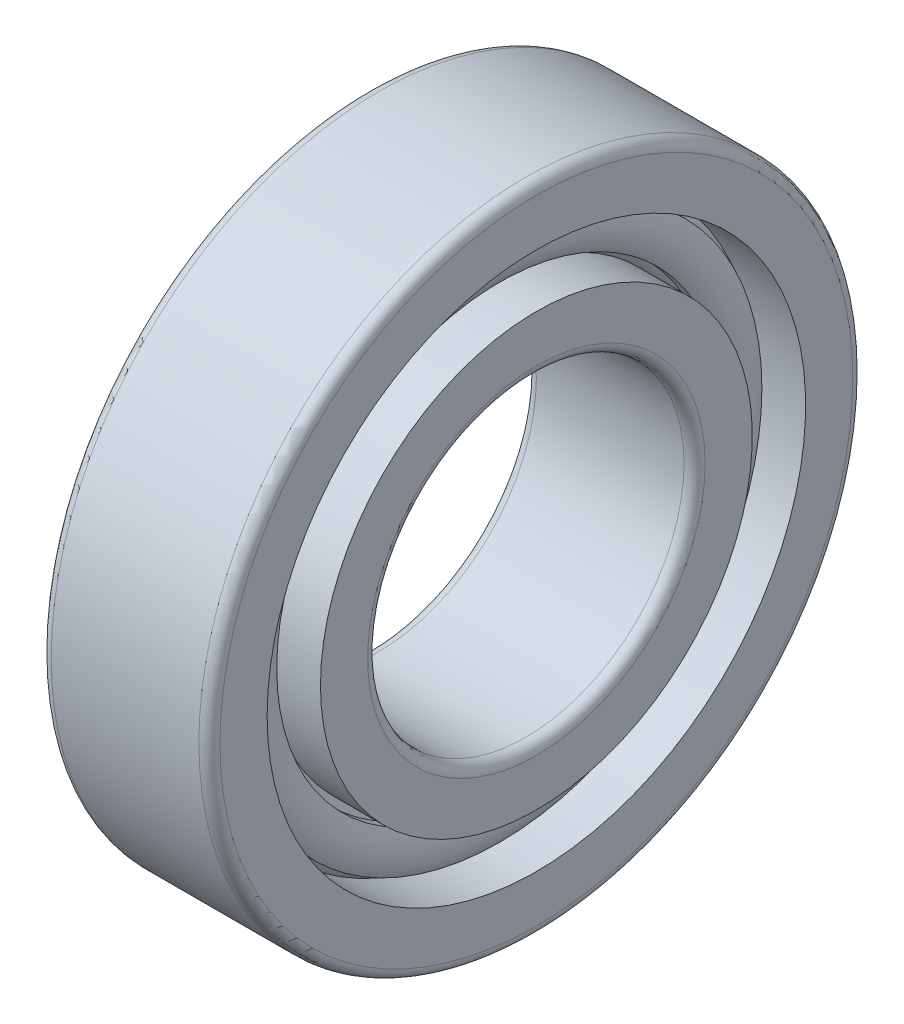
ISO-10303-21;
HEADER;
FILE_DESCRIPTION(('STEP AP214'),'2;1');
FILE_NAME('part.step','',(''),(''),'','','');
FILE_SCHEMA(('AUTOMOTIVE_DESIGN { 1 0 10303 214 1 1 1 1 }'));
ENDSEC;
DATA;
#1=APPLICATION_CONTEXT('core data for automotive mechanical design processes');
#2=APPLICATION_PROTOCOL_DEFINITION('international standard','automotive_design',2000,#1);
#3=PRODUCT_CONTEXT('',#1,'mechanical');
#4=PRODUCT('Part','Part','',(#3));
#5=PRODUCT_RELATED_PRODUCT_CATEGORY('part','',(#4));
#6=PRODUCT_DEFINITION_FORMATION('','',#4);
#7=PRODUCT_DEFINITION_CONTEXT('part definition',#1,'design');
#8=PRODUCT_DEFINITION('design','',#6,#7);
#9=PRODUCT_DEFINITION_SHAPE('','',#8);
#10=(LENGTH_UNIT() NAMED_UNIT(*) SI_UNIT(.MILLI.,.METRE.));
#11=(NAMED_UNIT(*) PLANE_ANGLE_UNIT() SI_UNIT($,.RADIAN.));
#12=(NAMED_UNIT(*) SI_UNIT($,.STERADIAN.) SOLID_ANGLE_UNIT());
#13=UNCERTAINTY_MEASURE_WITH_UNIT(LENGTH_MEASURE(1.E-05),#10,'distance_accuracy_value','');
#14=(GEOMETRIC_REPRESENTATION_CONTEXT(3) GLOBAL_UNCERTAINTY_ASSIGNED_CONTEXT((#13)) GLOBAL_UNIT_ASSIGNED_CONTEXT((#10,
#11,#12)) REPRESENTATION_CONTEXT('',''));
#15=CARTESIAN_POINT('',(0.,0.,0.));
#16=DIRECTION('',(0.,0.,1.));
#17=DIRECTION('',(1.,0.,0.));
#18=AXIS2_PLACEMENT_3D('',#15,#16,#17);
#19=CARTESIAN_POINT('',(15.,0.,0.));
#20=DIRECTION('',(-1.,0.,0.));
#21=DIRECTION('',(0.,0.,1.));
#22=AXIS2_PLACEMENT_3D('',#19,#20,#21);
#23=CYLINDRICAL_SURFACE('',#22,15.);
#24=CARTESIAN_POINT('',(1.,0.,0.));
#25=DIRECTION('',(1.,0.,0.));
#26=DIRECTION('',(0.,0.,-1.));
#27=AXIS2_PLACEMENT_3D('',#24,#25,#26);
#28=CIRCLE('',#27,15.);
#29=CARTESIAN_POINT('',(1.,0.,-15.));
#30=VERTEX_POINT('',#29);
#31=EDGE_CURVE('E228',#30,#30,#28,.T.);
#32=ORIENTED_EDGE('',*,*,#31,.F.);
#33=EDGE_LOOP('',(#32));
#34=FACE_BOUND('',#33,.T.);
#35=CARTESIAN_POINT('',(15.,0.,0.));
#36=DIRECTION('',(1.,0.,0.));
#37=DIRECTION('',(0.,0.,-1.));
#38=AXIS2_PLACEMENT_3D('',#35,#36,#37);
#39=CIRCLE('',#38,15.);
#40=CARTESIAN_POINT('',(15.,0.,-15.));
#41=VERTEX_POINT('',#40);
#42=EDGE_CURVE('E224',#41,#41,#39,.F.);
#43=ORIENTED_EDGE('',*,*,#42,.F.);
#44=EDGE_LOOP('',(#43));
#45=FACE_BOUND('',#44,.T.);
#46=ADVANCED_FACE('F14',(#34,#45),#23,.F.);
#47=CARTESIAN_POINT('',(1.,0.,0.));
#48=DIRECTION('',(1.,0.,0.));
#49=DIRECTION('',(0.,0.,-1.));
#50=AXIS2_PLACEMENT_3D('',#47,#48,#49);
#51=TOROIDAL_SURFACE('',#50,16.,1.);
#52=CARTESIAN_POINT('',(0.,0.,0.));
#53=DIRECTION('',(-1.,0.,0.));
#54=DIRECTION('',(0.,0.,-1.));
#55=AXIS2_PLACEMENT_3D('',#52,#53,#54);
#56=CIRCLE('',#55,16.);
#57=CARTESIAN_POINT('',(0.,0.,-16.));
#58=VERTEX_POINT('',#57);
#59=EDGE_CURVE('E227',#58,#58,#56,.F.);
#60=ORIENTED_EDGE('',*,*,#59,.F.);
#61=EDGE_LOOP('',(#60));
#62=FACE_BOUND('',#61,.T.);
#63=ORIENTED_EDGE('',*,*,#31,.T.);
#64=EDGE_LOOP('',(#63));
#65=FACE_BOUND('',#64,.T.);
#66=ADVANCED_FACE('F244',(#62,#65),#51,.T.);
#67=CARTESIAN_POINT('',(15.,0.,0.));
#68=DIRECTION('',(1.,0.,0.));
#69=DIRECTION('',(0.,0.,-1.));
#70=AXIS2_PLACEMENT_3D('',#67,#68,#69);
#71=TOROIDAL_SURFACE('',#70,16.,1.);
#72=ORIENTED_EDGE('',*,*,#42,.T.);
#73=EDGE_LOOP('',(#72));
#74=FACE_BOUND('',#73,.T.);
#75=CARTESIAN_POINT('',(16.,0.,0.));
#76=DIRECTION('',(1.,0.,0.));
#77=DIRECTION('',(0.,0.,-1.));
#78=AXIS2_PLACEMENT_3D('',#75,#76,#77);
#79=CIRCLE('',#78,16.);
#80=CARTESIAN_POINT('',(16.,0.,-16.));
#81=VERTEX_POINT('',#80);
#82=EDGE_CURVE('E190',#81,#81,#79,.F.);
#83=ORIENTED_EDGE('',*,*,#82,.F.);
#84=EDGE_LOOP('',(#83));
#85=FACE_BOUND('',#84,.T.);
#86=ADVANCED_FACE('F211',(#74,#85),#71,.T.);
#87=CARTESIAN_POINT('',(0.,20.472,0.));
#88=DIRECTION('',(-1.,0.,0.));
#89=DIRECTION('',(0.,0.,1.));
#90=AXIS2_PLACEMENT_3D('',#87,#88,#89);
#91=PLANE('',#90);
#92=CARTESIAN_POINT('',(0.,0.,0.));
#93=DIRECTION('',(-1.,0.,0.));
#94=DIRECTION('',(0.,0.,1.));
#95=AXIS2_PLACEMENT_3D('',#92,#93,#94);
#96=CIRCLE('',#95,20.472);
#97=CARTESIAN_POINT('',(0.,0.,20.472));
#98=VERTEX_POINT('',#97);
#99=EDGE_CURVE('E17',#98,#98,#96,.F.);
#100=ORIENTED_EDGE('',*,*,#99,.F.);
#101=EDGE_LOOP('',(#100));
#102=FACE_BOUND('',#101,.T.);
#103=ORIENTED_EDGE('',*,*,#59,.T.);
#104=EDGE_LOOP('',(#103));
#105=FACE_BOUND('',#104,.T.);
#106=ADVANCED_FACE('F207',(#102,#105),#91,.T.);
#107=CARTESIAN_POINT('',(16.,16.,0.));
#108=DIRECTION('',(1.,0.,0.));
#109=DIRECTION('',(0.,0.,-1.));
#110=AXIS2_PLACEMENT_3D('',#107,#108,#109);
#111=PLANE('',#110);
#112=ORIENTED_EDGE('',*,*,#82,.T.);
#113=EDGE_LOOP('',(#112));
#114=FACE_BOUND('',#113,.T.);
#115=CARTESIAN_POINT('',(16.,0.,0.));
#116=DIRECTION('',(-1.,0.,0.));
#117=DIRECTION('',(0.,0.,1.));
#118=AXIS2_PLACEMENT_3D('',#115,#116,#117);
#119=CIRCLE('',#118,20.472);
#120=CARTESIAN_POINT('',(16.,0.,20.472));
#121=VERTEX_POINT('',#120);
#122=EDGE_CURVE('E183',#121,#121,#119,.T.);
#123=ORIENTED_EDGE('',*,*,#122,.F.);
#124=EDGE_LOOP('',(#123));
#125=FACE_BOUND('',#124,.T.);
#126=ADVANCED_FACE('F197',(#114,#125),#111,.T.);
#127=CARTESIAN_POINT('',(15.,0.,0.));
#128=DIRECTION('',(-1.,0.,0.));
#129=DIRECTION('',(0.,0.,1.));
#130=AXIS2_PLACEMENT_3D('',#127,#128,#129);
#131=CYLINDRICAL_SURFACE('',#130,20.472);
#132=CARTESIAN_POINT('',(4.882,0.,0.));
#133=DIRECTION('',(1.,0.,0.));
#134=DIRECTION('',(0.,0.,-1.));
#135=AXIS2_PLACEMENT_3D('',#132,#133,#134);
#136=CIRCLE('',#135,20.472);
#137=CARTESIAN_POINT('',(4.882,0.,-20.472));
#138=VERTEX_POINT('',#137);
#139=EDGE_CURVE('E180',#138,#138,#136,.T.);
#140=ORIENTED_EDGE('',*,*,#139,.F.);
#141=EDGE_LOOP('',(#140));
#142=FACE_BOUND('',#141,.T.);
#143=ORIENTED_EDGE('',*,*,#99,.T.);
#144=EDGE_LOOP('',(#143));
#145=FACE_BOUND('',#144,.T.);
#146=ADVANCED_FACE('F206',(#142,#145),#131,.T.);
#147=CARTESIAN_POINT('',(15.,0.,0.));
#148=DIRECTION('',(-1.,0.,0.));
#149=DIRECTION('',(0.,0.,1.));
#150=AXIS2_PLACEMENT_3D('',#147,#148,#149);
#151=CYLINDRICAL_SURFACE('',#150,20.472);
#152=ORIENTED_EDGE('',*,*,#122,.T.);
#153=EDGE_LOOP('',(#152));
#154=FACE_BOUND('',#153,.T.);
#155=CARTESIAN_POINT('',(11.117,0.,0.));
#156=DIRECTION('',(1.,0.,0.));
#157=DIRECTION('',(0.,0.,-1.));
#158=AXIS2_PLACEMENT_3D('',#155,#156,#157);
#159=CIRCLE('',#158,20.472);
#160=CARTESIAN_POINT('',(11.117,0.,-20.472));
#161=VERTEX_POINT('',#160);
#162=EDGE_CURVE('E158',#161,#161,#159,.F.);
#163=ORIENTED_EDGE('',*,*,#162,.F.);
#164=EDGE_LOOP('',(#163));
#165=FACE_BOUND('',#164,.T.);
#166=ADVANCED_FACE('F174',(#154,#165),#151,.T.);
#167=CARTESIAN_POINT('',(7.99919277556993,0.,0.));
#168=DIRECTION('',(1.,0.,0.));
#169=DIRECTION('',(0.,0.,-1.));
#170=AXIS2_PLACEMENT_3D('',#167,#168,#169);
#171=TOROIDAL_SURFACE('',#170,23.0008940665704,4.014);
#172=CARTESIAN_POINT('',(4.44,0.,0.));
#173=DIRECTION('',(-1.,0.,0.));
#174=DIRECTION('',(0.,0.,1.));
#175=AXIS2_PLACEMENT_3D('',#172,#173,#174);
#176=CIRCLE('',#175,21.145);
#177=CARTESIAN_POINT('',(4.44,0.,21.145));
#178=VERTEX_POINT('',#177);
#179=EDGE_CURVE('E153',#178,#178,#176,.T.);
#180=ORIENTED_EDGE('',*,*,#179,.T.);
#181=EDGE_LOOP('',(#180));
#182=FACE_BOUND('',#181,.T.);
#183=ORIENTED_EDGE('',*,*,#139,.T.);
#184=EDGE_LOOP('',(#183));
#185=FACE_BOUND('',#184,.T.);
#186=ADVANCED_FACE('F169',(#182,#185),#171,.T.);
#187=CARTESIAN_POINT('',(7.99980722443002,0.,0.));
#188=DIRECTION('',(1.,0.,0.));
#189=DIRECTION('',(0.,0.,-1.));
#190=AXIS2_PLACEMENT_3D('',#187,#188,#189);
#191=TOROIDAL_SURFACE('',#190,23.0008940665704,4.01400000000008);
#192=ORIENTED_EDGE('',*,*,#162,.T.);
#193=EDGE_LOOP('',(#192));
#194=FACE_BOUND('',#193,.T.);
#195=CARTESIAN_POINT('',(11.559,0.,0.));
#196=DIRECTION('',(-1.,0.,0.));
#197=DIRECTION('',(0.,0.,1.));
#198=AXIS2_PLACEMENT_3D('',#195,#196,#197);
#199=CIRCLE('',#198,21.145);
#200=CARTESIAN_POINT('',(11.559,0.,21.145));
#201=VERTEX_POINT('',#200);
#202=EDGE_CURVE('E148',#201,#201,#199,.F.);
#203=ORIENTED_EDGE('',*,*,#202,.T.);
#204=EDGE_LOOP('',(#203));
#205=FACE_BOUND('',#204,.T.);
#206=ADVANCED_FACE('F165',(#194,#205),#191,.T.);
#207=CARTESIAN_POINT('',(15.,0.,0.));
#208=DIRECTION('',(-1.,0.,0.));
#209=DIRECTION('',(0.,0.,1.));
#210=AXIS2_PLACEMENT_3D('',#207,#208,#209);
#211=CYLINDRICAL_SURFACE('',#210,21.145);
#212=CARTESIAN_POINT('',(3.472,0.,0.));
#213=DIRECTION('',(1.,0.,0.));
#214=DIRECTION('',(0.,0.,-1.));
#215=AXIS2_PLACEMENT_3D('',#212,#213,#214);
#216=CIRCLE('',#215,21.145);
#217=CARTESIAN_POINT('',(3.472,0.,-21.145));
#218=VERTEX_POINT('',#217);
#219=EDGE_CURVE('E145',#218,#218,#216,.T.);
#220=ORIENTED_EDGE('',*,*,#219,.F.);
#221=EDGE_LOOP('',(#220));
#222=FACE_BOUND('',#221,.T.);
#223=ORIENTED_EDGE('',*,*,#179,.F.);
#224=EDGE_LOOP('',(#223));
#225=FACE_BOUND('',#224,.T.);
#226=ADVANCED_FACE('F168',(#222,#225),#211,.F.);
#227=CARTESIAN_POINT('',(15.,0.,0.));
#228=DIRECTION('',(-1.,0.,0.));
#229=DIRECTION('',(0.,0.,1.));
#230=AXIS2_PLACEMENT_3D('',#227,#228,#229);
#231=CYLINDRICAL_SURFACE('',#230,21.145);
#232=ORIENTED_EDGE('',*,*,#202,.F.);
#233=EDGE_LOOP('',(#232));
#234=FACE_BOUND('',#233,.T.);
#235=CARTESIAN_POINT('',(12.528,0.,0.));
#236=DIRECTION('',(1.,0.,0.));
#237=DIRECTION('',(0.,0.,-1.));
#238=AXIS2_PLACEMENT_3D('',#235,#236,#237);
#239=CIRCLE('',#238,21.145);
#240=CARTESIAN_POINT('',(12.528,0.,-21.145));
#241=VERTEX_POINT('',#240);
#242=EDGE_CURVE('E122',#241,#241,#239,.F.);
#243=ORIENTED_EDGE('',*,*,#242,.F.);
#244=EDGE_LOOP('',(#243));
#245=FACE_BOUND('',#244,.T.);
#246=ADVANCED_FACE('F139',(#234,#245),#231,.F.);
#247=CARTESIAN_POINT('',(7.0313982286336,0.,0.));
#248=DIRECTION('',(1.,0.,0.));
#249=DIRECTION('',(0.,0.,-1.));
#250=AXIS2_PLACEMENT_3D('',#247,#248,#249);
#251=TOROIDAL_SURFACE('',#250,23.0005,4.014);
#252=CARTESIAN_POINT('',(3.472,0.,0.));
#253=DIRECTION('',(-1.,0.,0.));
#254=DIRECTION('',(0.,0.,1.));
#255=AXIS2_PLACEMENT_3D('',#252,#253,#254);
#256=CIRCLE('',#255,24.856);
#257=CARTESIAN_POINT('',(3.472,0.,24.856));
#258=VERTEX_POINT('',#257);
#259=EDGE_CURVE('E117',#258,#258,#256,.F.);
#260=ORIENTED_EDGE('',*,*,#259,.F.);
#261=EDGE_LOOP('',(#260));
#262=FACE_BOUND('',#261,.T.);
#263=ORIENTED_EDGE('',*,*,#219,.T.);
#264=EDGE_LOOP('',(#263));
#265=FACE_BOUND('',#264,.T.);
#266=ADVANCED_FACE('F134',(#262,#265),#251,.T.);
#267=CARTESIAN_POINT('',(8.96860177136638,0.,0.));
#268=DIRECTION('',(1.,0.,0.));
#269=DIRECTION('',(0.,0.,-1.));
#270=AXIS2_PLACEMENT_3D('',#267,#268,#269);
#271=TOROIDAL_SURFACE('',#270,23.0005,4.014);
#272=ORIENTED_EDGE('',*,*,#242,.T.);
#273=EDGE_LOOP('',(#272));
#274=FACE_BOUND('',#273,.T.);
#275=CARTESIAN_POINT('',(12.528,0.,0.));
#276=DIRECTION('',(-1.,0.,0.));
#277=DIRECTION('',(0.,0.,1.));
#278=AXIS2_PLACEMENT_3D('',#275,#276,#277);
#279=CIRCLE('',#278,24.856);
#280=CARTESIAN_POINT('',(12.528,0.,24.856));
#281=VERTEX_POINT('',#280);
#282=EDGE_CURVE('E112',#281,#281,#279,.T.);
#283=ORIENTED_EDGE('',*,*,#282,.F.);
#284=EDGE_LOOP('',(#283));
#285=FACE_BOUND('',#284,.T.);
#286=ADVANCED_FACE('F129',(#274,#285),#271,.T.);
#287=CARTESIAN_POINT('',(15.,0.,0.));
#288=DIRECTION('',(-1.,0.,0.));
#289=DIRECTION('',(0.,0.,1.));
#290=AXIS2_PLACEMENT_3D('',#287,#288,#289);
#291=CYLINDRICAL_SURFACE('',#290,24.856);
#292=CARTESIAN_POINT('',(4.44,0.,0.));
#293=DIRECTION('',(1.,0.,0.));
#294=DIRECTION('',(0.,0.,-1.));
#295=AXIS2_PLACEMENT_3D('',#292,#293,#294);
#296=CIRCLE('',#295,24.856);
#297=CARTESIAN_POINT('',(4.44,0.,-24.856));
#298=VERTEX_POINT('',#297);
#299=EDGE_CURVE('E106',#298,#298,#296,.T.);
#300=ORIENTED_EDGE('',*,*,#299,.F.);
#301=EDGE_LOOP('',(#300));
#302=FACE_BOUND('',#301,.T.);
#303=ORIENTED_EDGE('',*,*,#259,.T.);
#304=EDGE_LOOP('',(#303));
#305=FACE_BOUND('',#304,.T.);
#306=ADVANCED_FACE('F133',(#302,#305),#291,.T.);
#307=CARTESIAN_POINT('',(15.,0.,0.));
#308=DIRECTION('',(-1.,0.,0.));
#309=DIRECTION('',(0.,0.,1.));
#310=AXIS2_PLACEMENT_3D('',#307,#308,#309);
#311=CYLINDRICAL_SURFACE('',#310,24.856);
#312=ORIENTED_EDGE('',*,*,#282,.T.);
#313=EDGE_LOOP('',(#312));
#314=FACE_BOUND('',#313,.T.);
#315=CARTESIAN_POINT('',(11.559,0.,0.));
#316=DIRECTION('',(1.,0.,0.));
#317=DIRECTION('',(0.,0.,-1.));
#318=AXIS2_PLACEMENT_3D('',#315,#316,#317);
#319=CIRCLE('',#318,24.856);
#320=CARTESIAN_POINT('',(11.559,0.,-24.856));
#321=VERTEX_POINT('',#320);
#322=EDGE_CURVE('E102',#321,#321,#319,.F.);
#323=ORIENTED_EDGE('',*,*,#322,.F.);
#324=EDGE_LOOP('',(#323));
#325=FACE_BOUND('',#324,.T.);
#326=ADVANCED_FACE('F447',(#314,#325),#311,.T.);
#327=CARTESIAN_POINT('',(7.99919277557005,0.,0.));
#328=DIRECTION('',(1.,0.,0.));
#329=DIRECTION('',(0.,0.,-1.));
#330=AXIS2_PLACEMENT_3D('',#327,#328,#329);
#331=TOROIDAL_SURFACE('',#330,23.0001059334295,4.01400000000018);
#332=CARTESIAN_POINT('',(4.882,0.,0.));
#333=DIRECTION('',(-1.,0.,0.));
#334=DIRECTION('',(0.,0.,1.));
#335=AXIS2_PLACEMENT_3D('',#332,#333,#334);
#336=CIRCLE('',#335,25.529);
#337=CARTESIAN_POINT('',(4.882,0.,25.529));
#338=VERTEX_POINT('',#337);
#339=EDGE_CURVE('E105',#338,#338,#336,.T.);
#340=ORIENTED_EDGE('',*,*,#339,.T.);
#341=EDGE_LOOP('',(#340));
#342=FACE_BOUND('',#341,.T.);
#343=ORIENTED_EDGE('',*,*,#299,.T.);
#344=EDGE_LOOP('',(#343));
#345=FACE_BOUND('',#344,.T.);
#346=ADVANCED_FACE('F93',(#342,#345),#331,.T.);
#347=CARTESIAN_POINT('',(7.99980722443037,0.,0.));
#348=DIRECTION('',(1.,0.,0.));
#349=DIRECTION('',(0.,0.,-1.));
#350=AXIS2_PLACEMENT_3D('',#347,#348,#349);
#351=TOROIDAL_SURFACE('',#350,23.0001059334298,4.01399999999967);
#352=ORIENTED_EDGE('',*,*,#322,.T.);
#353=EDGE_LOOP('',(#352));
#354=FACE_BOUND('',#353,.T.);
#355=CARTESIAN_POINT('',(11.117,0.,0.));
#356=DIRECTION('',(-1.,0.,0.));
#357=DIRECTION('',(0.,0.,1.));
#358=AXIS2_PLACEMENT_3D('',#355,#356,#357);
#359=CIRCLE('',#358,25.529);
#360=CARTESIAN_POINT('',(11.117,0.,25.529));
#361=VERTEX_POINT('',#360);
#362=EDGE_CURVE('E264',#361,#361,#359,.F.);
#363=ORIENTED_EDGE('',*,*,#362,.T.);
#364=EDGE_LOOP('',(#363));
#365=FACE_BOUND('',#364,.T.);
#366=ADVANCED_FACE('F88',(#354,#365),#351,.T.);
#367=CARTESIAN_POINT('',(15.,0.,0.));
#368=DIRECTION('',(-1.,0.,0.));
#369=DIRECTION('',(0.,0.,1.));
#370=AXIS2_PLACEMENT_3D('',#367,#368,#369);
#371=CYLINDRICAL_SURFACE('',#370,25.529);
#372=CARTESIAN_POINT('',(0.,0.,0.));
#373=DIRECTION('',(-1.,0.,0.));
#374=DIRECTION('',(0.,0.,1.));
#375=AXIS2_PLACEMENT_3D('',#372,#373,#374);
#376=CIRCLE('',#375,25.529);
#377=CARTESIAN_POINT('',(0.,0.,25.529));
#378=VERTEX_POINT('',#377);
#379=EDGE_CURVE('E262',#378,#378,#376,.F.);
#380=ORIENTED_EDGE('',*,*,#379,.F.);
#381=EDGE_LOOP('',(#380));
#382=FACE_BOUND('',#381,.T.);
#383=ORIENTED_EDGE('',*,*,#339,.F.);
#384=EDGE_LOOP('',(#383));
#385=FACE_BOUND('',#384,.T.);
#386=ADVANCED_FACE('F84',(#382,#385),#371,.F.);
#387=CARTESIAN_POINT('',(15.,0.,0.));
#388=DIRECTION('',(-1.,0.,0.));
#389=DIRECTION('',(0.,0.,1.));
#390=AXIS2_PLACEMENT_3D('',#387,#388,#389);
#391=CYLINDRICAL_SURFACE('',#390,25.529);
#392=ORIENTED_EDGE('',*,*,#362,.F.);
#393=EDGE_LOOP('',(#392));
#394=FACE_BOUND('',#393,.T.);
#395=CARTESIAN_POINT('',(16.,0.,0.));
#396=DIRECTION('',(-1.,0.,0.));
#397=DIRECTION('',(0.,0.,1.));
#398=AXIS2_PLACEMENT_3D('',#395,#396,#397);
#399=CIRCLE('',#398,25.529);
#400=CARTESIAN_POINT('',(16.,0.,25.529));
#401=VERTEX_POINT('',#400);
#402=EDGE_CURVE('E254',#401,#401,#399,.T.);
#403=ORIENTED_EDGE('',*,*,#402,.F.);
#404=EDGE_LOOP('',(#403));
#405=FACE_BOUND('',#404,.T.);
#406=ADVANCED_FACE('F80',(#394,#405),#391,.F.);
#407=CARTESIAN_POINT('',(0.,30.,0.));
#408=DIRECTION('',(-1.,0.,0.));
#409=DIRECTION('',(0.,0.,1.));
#410=AXIS2_PLACEMENT_3D('',#407,#408,#409);
#411=PLANE('',#410);
#412=CARTESIAN_POINT('',(0.,0.,0.));
#413=DIRECTION('',(1.,0.,0.));
#414=DIRECTION('',(0.,0.,-1.));
#415=AXIS2_PLACEMENT_3D('',#412,#413,#414);
#416=CIRCLE('',#415,30.);
#417=CARTESIAN_POINT('',(0.,0.,-30.));
#418=VERTEX_POINT('',#417);
#419=EDGE_CURVE('E64',#418,#418,#416,.T.);
#420=ORIENTED_EDGE('',*,*,#419,.F.);
#421=EDGE_LOOP('',(#420));
#422=FACE_BOUND('',#421,.T.);
#423=ORIENTED_EDGE('',*,*,#379,.T.);
#424=EDGE_LOOP('',(#423));
#425=FACE_BOUND('',#424,.T.);
#426=ADVANCED_FACE('F70',(#422,#425),#411,.T.);
#427=CARTESIAN_POINT('',(16.,25.529,0.));
#428=DIRECTION('',(1.,0.,0.));
#429=DIRECTION('',(0.,0.,-1.));
#430=AXIS2_PLACEMENT_3D('',#427,#428,#429);
#431=PLANE('',#430);
#432=ORIENTED_EDGE('',*,*,#402,.T.);
#433=EDGE_LOOP('',(#432));
#434=FACE_BOUND('',#433,.T.);
#435=CARTESIAN_POINT('',(16.,0.,0.));
#436=DIRECTION('',(-1.,0.,0.));
#437=DIRECTION('',(0.,0.,-1.));
#438=AXIS2_PLACEMENT_3D('',#435,#436,#437);
#439=CIRCLE('',#438,30.);
#440=CARTESIAN_POINT('',(16.,1.25878882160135E-13,-30.));
#441=VERTEX_POINT('',#440);
#442=EDGE_CURVE('E26',#441,#441,#439,.T.);
#443=ORIENTED_EDGE('',*,*,#442,.F.);
#444=EDGE_LOOP('',(#443));
#445=FACE_BOUND('',#444,.T.);
#446=ADVANCED_FACE('F79',(#434,#445),#431,.T.);
#447=CARTESIAN_POINT('',(1.,0.,0.));
#448=DIRECTION('',(1.,0.,0.));
#449=DIRECTION('',(0.,0.,-1.));
#450=AXIS2_PLACEMENT_3D('',#447,#448,#449);
#451=TOROIDAL_SURFACE('',#450,30.,1.);
#452=CARTESIAN_POINT('',(1.,0.,0.));
#453=DIRECTION('',(-1.,0.,0.));
#454=DIRECTION('',(0.,0.,1.));
#455=AXIS2_PLACEMENT_3D('',#452,#453,#454);
#456=CIRCLE('',#455,31.);
#457=CARTESIAN_POINT('',(1.,0.,31.));
#458=VERTEX_POINT('',#457);
#459=EDGE_CURVE('E21',#458,#458,#456,.F.);
#460=ORIENTED_EDGE('',*,*,#459,.F.);
#461=EDGE_LOOP('',(#460));
#462=FACE_BOUND('',#461,.T.);
#463=ORIENTED_EDGE('',*,*,#419,.T.);
#464=EDGE_LOOP('',(#463));
#465=FACE_BOUND('',#464,.T.);
#466=ADVANCED_FACE('F44',(#462,#465),#451,.T.);
#467=CARTESIAN_POINT('',(15.,0.,0.));
#468=DIRECTION('',(1.,0.,0.));
#469=DIRECTION('',(0.,0.,-1.));
#470=AXIS2_PLACEMENT_3D('',#467,#468,#469);
#471=TOROIDAL_SURFACE('',#470,30.,1.);
#472=ORIENTED_EDGE('',*,*,#442,.T.);
#473=EDGE_LOOP('',(#472));
#474=FACE_BOUND('',#473,.T.);
#475=CARTESIAN_POINT('',(15.,0.,0.));
#476=DIRECTION('',(-1.,0.,0.));
#477=DIRECTION('',(0.,0.,1.));
#478=AXIS2_PLACEMENT_3D('',#475,#476,#477);
#479=CIRCLE('',#478,31.);
#480=CARTESIAN_POINT('',(15.,0.,31.));
#481=VERTEX_POINT('',#480);
#482=EDGE_CURVE('E10',#481,#481,#479,.T.);
#483=ORIENTED_EDGE('',*,*,#482,.F.);
#484=EDGE_LOOP('',(#483));
#485=FACE_BOUND('',#484,.T.);
#486=ADVANCED_FACE('F38',(#474,#485),#471,.T.);
#487=CARTESIAN_POINT('',(15.,0.,0.));
#488=DIRECTION('',(-1.,0.,0.));
#489=DIRECTION('',(0.,0.,1.));
#490=AXIS2_PLACEMENT_3D('',#487,#488,#489);
#491=CYLINDRICAL_SURFACE('',#490,31.);
#492=ORIENTED_EDGE('',*,*,#482,.T.);
#493=EDGE_LOOP('',(#492));
#494=FACE_BOUND('',#493,.T.);
#495=ORIENTED_EDGE('',*,*,#459,.T.);
#496=EDGE_LOOP('',(#495));
#497=FACE_BOUND('',#496,.T.);
#498=ADVANCED_FACE('F43',(#494,#497),#491,.T.);
#499=CLOSED_SHELL('',(#46,#66,#86,#106,#126,#146,#166,#186,#206,#226,#246,#266,#286,#306,#326,
#346,#366,#386,#406,#426,#446,#466,#486,#498));
#500=MANIFOLD_SOLID_BREP('B1',#499);
#501=ADVANCED_BREP_SHAPE_REPRESENTATION('',(#18,#500),#14);
#502=SHAPE_DEFINITION_REPRESENTATION(#9,#501);
ENDSEC;
END-ISO-10303-21;
